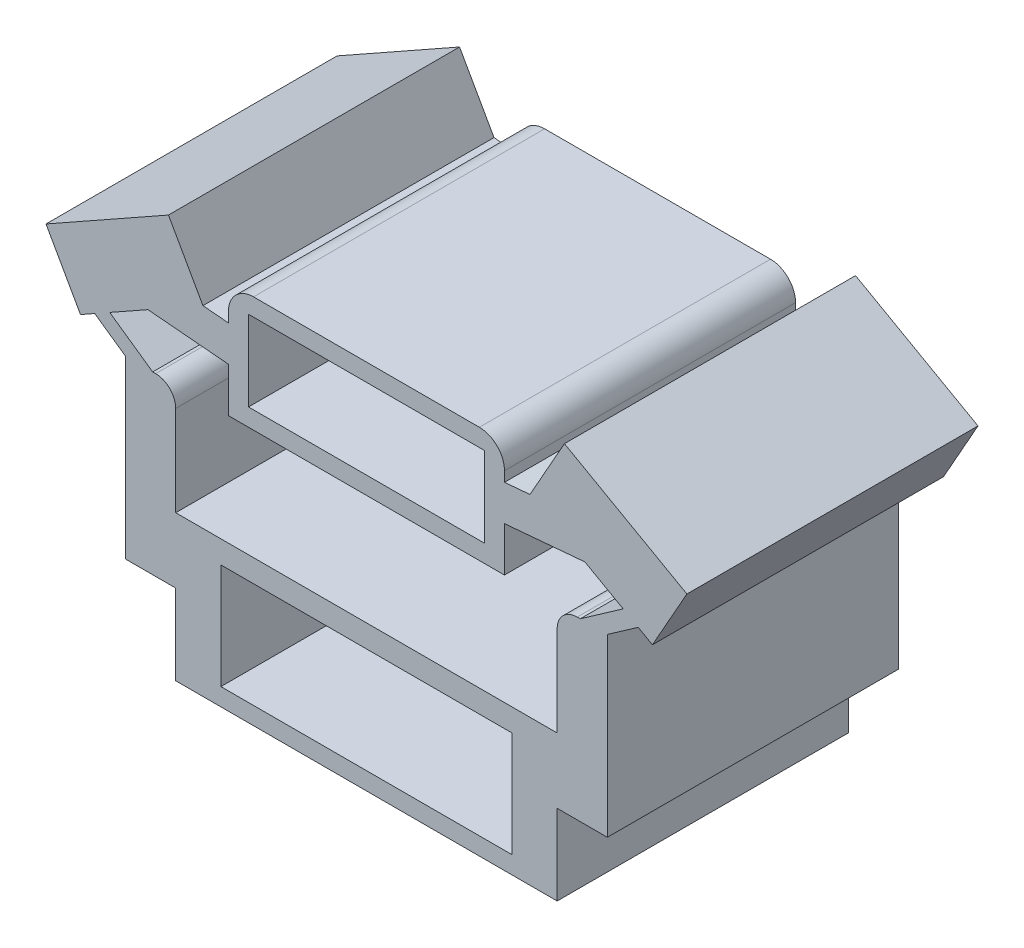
from build123d import *

# Parameters (mm, degrees)
EXTRUDE_1_DEPTH     = 5.8
SKETCH_10_W         = 5.8
SKETCH_10_H         = 2.1
SKETCH_10_W_2       = 4.7
SKETCH_10_H_2       = 1.6
CUT_EXTRUDE_3_DEPTH = 11.779274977
EXTRUDE_2_DEPTH     = 5.8
FILLET_1_R          = 0.5
SKETCH_12_W         = 5.8
SKETCH_12_H         = 0.1
SKETCH_12_W_2       = 7.6
EXTRUDE_3_DEPTH     = 5.8
SKETCH_14_W         = 5.8
SKETCH_14_H         = 0.1
CUT_EXTRUDE_4_DEPTH = 11.779274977
FILLET_2_R          = 0.4


with BuildPart() as part:
    # Sketch 1 → Extrude 1 (new body)
    with BuildSketch(Plane.XY):
        Polygon((2.75, 5.2), (3.258059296, 5.244449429), (3.945003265, 6.464329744), (6.384763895, 5.090441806), (5.697819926, 3.870561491), (5.414364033, 4.030182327), (4.8, 3.6), (4.8, 0.1), (3.8, 0.1), (3.8, -1.4), (-3.8, -1.4), (-3.8, 1.4), (3.8, 1.4), (3.8, 3.6), (4.259531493, 3.6), (5.114806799, 4.198870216), (4.353506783, 4.627576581), (2.75, 4.487287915), (2.75, 3.6), (-2.75, 3.6), (-2.75, 5.2), align=None)
    extrude_1 = extrude(amount=EXTRUDE_1_DEPTH)

    # Mirror 1: Extrude 1 across plane
    add(extrude_1.mirror(Plane(origin=(0, 0, 0), x_dir=(0, 0, 1), z_dir=(1, 0, 0))))

    # Sketch 10 → Cut-Extrude 3 (cut, through all)
    with BuildSketch(Plane.XY.offset(5.8)):
        Rectangle(SKETCH_10_W, SKETCH_10_H)
        with Locations((0, 4.75)):
            Rectangle(SKETCH_10_W_2, SKETCH_10_H_2)
    extrude(amount=-CUT_EXTRUDE_3_DEPTH, mode=Mode.SUBTRACT)

    # Sketch 11 → Extrude 2 (add)
    with BuildSketch(Plane.XY.offset(5.8)):
        Polygon((-2.35, 5.2), (-2.75, 5.2), (-2.75, 5.9), (2.75, 5.9), (2.75, 5.2), (2.35, 5.2), (2.35, 5.55), (-2.35, 5.55), align=None)
    extrude(amount=-EXTRUDE_2_DEPTH)

    # Fillet 1
    fillet_1_edges = [part.edges().sort_by_distance(p)[0] for p in [
        (2.75, 5.9, 2.9),
        (-2.75, 5.9, 2.9),
    ]]
    fillet(fillet_1_edges, radius=FILLET_1_R)

    # Sketch 12 → Extrude 3 (add)
    with BuildSketch(Plane.XY.offset(5.8)):
        with Locations((0, 1)):
            Rectangle(SKETCH_12_W, SKETCH_12_H)
        with Locations((0, -1.45)):
            Rectangle(SKETCH_12_W_2, SKETCH_12_H)
    extrude(amount=-EXTRUDE_3_DEPTH)

    # Sketch 14 → Cut-Extrude 4 (cut, through all)
    with BuildSketch(Plane.XY.offset(5.8)):
        with Locations((0, -1.1)):
            Rectangle(SKETCH_14_W, SKETCH_14_H)
    extrude(amount=-CUT_EXTRUDE_4_DEPTH, mode=Mode.SUBTRACT)

    # Fillet 2
    fillet_2_edges = [part.edges().sort_by_distance(p)[0] for p in [
        (3.8, 3.6, 2.9),
        (-3.8, 3.6, 2.9),
    ]]
    fillet(fillet_2_edges, radius=FILLET_2_R)


solid = part.part
